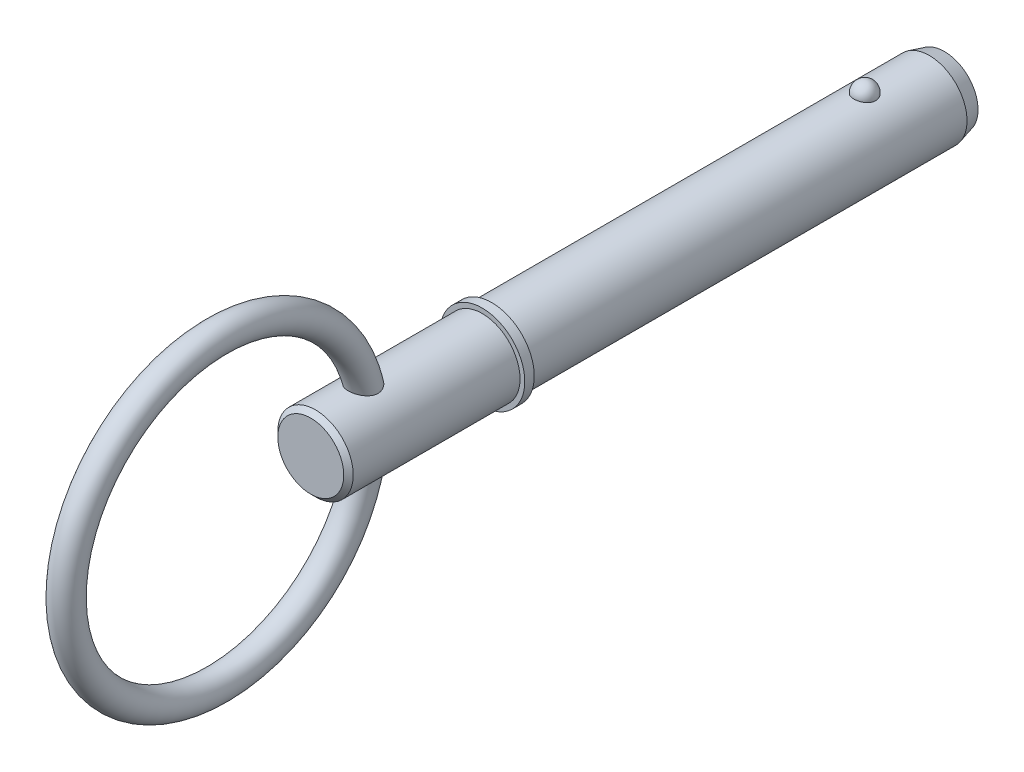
ISO-10303-21;
HEADER;
FILE_DESCRIPTION(('STEP AP214'),'2;1');
FILE_NAME('part.step','',(''),(''),'','','');
FILE_SCHEMA(('AUTOMOTIVE_DESIGN { 1 0 10303 214 1 1 1 1 }'));
ENDSEC;
DATA;
#1=APPLICATION_CONTEXT('core data for automotive mechanical design processes');
#2=APPLICATION_PROTOCOL_DEFINITION('international standard','automotive_design',2000,#1);
#3=PRODUCT_CONTEXT('',#1,'mechanical');
#4=PRODUCT('Part','Part','',(#3));
#5=PRODUCT_RELATED_PRODUCT_CATEGORY('part','',(#4));
#6=PRODUCT_DEFINITION_FORMATION('','',#4);
#7=PRODUCT_DEFINITION_CONTEXT('part definition',#1,'design');
#8=PRODUCT_DEFINITION('design','',#6,#7);
#9=PRODUCT_DEFINITION_SHAPE('','',#8);
#10=(LENGTH_UNIT() NAMED_UNIT(*) SI_UNIT(.MILLI.,.METRE.));
#11=(NAMED_UNIT(*) PLANE_ANGLE_UNIT() SI_UNIT($,.RADIAN.));
#12=(NAMED_UNIT(*) SI_UNIT($,.STERADIAN.) SOLID_ANGLE_UNIT());
#13=UNCERTAINTY_MEASURE_WITH_UNIT(LENGTH_MEASURE(1.E-05),#10,'distance_accuracy_value','');
#14=(GEOMETRIC_REPRESENTATION_CONTEXT(3) GLOBAL_UNCERTAINTY_ASSIGNED_CONTEXT((#13)) GLOBAL_UNIT_ASSIGNED_CONTEXT((#10,
#11,#12)) REPRESENTATION_CONTEXT('',''));
#15=CARTESIAN_POINT('',(0.,0.,0.));
#16=DIRECTION('',(0.,0.,1.));
#17=DIRECTION('',(1.,0.,0.));
#18=AXIS2_PLACEMENT_3D('',#15,#16,#17);
#19=CARTESIAN_POINT('',(0.,0.,38.1));
#20=DIRECTION('',(0.,0.,-1.));
#21=DIRECTION('',(-1.,0.,0.));
#22=AXIS2_PLACEMENT_3D('',#19,#20,#21);
#23=CYLINDRICAL_SURFACE('',#22,3.97);
#24=CARTESIAN_POINT('',(1.13787398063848,3.80343828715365,-1.15));
#25=CARTESIAN_POINT('',(1.13787307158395,3.80343910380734,-1.0857397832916));
#26=CARTESIAN_POINT('',(1.13264657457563,3.80501406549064,-1.02146820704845));
#27=CARTESIAN_POINT('',(1.11186534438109,3.81113760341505,-0.894749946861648));
#28=CARTESIAN_POINT('',(1.09630734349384,3.81568712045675,-0.832303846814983));
#29=CARTESIAN_POINT('',(1.05525533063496,3.82724281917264,-0.711040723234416));
#30=CARTESIAN_POINT('',(1.02976565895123,3.83424792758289,-0.65222212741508));
#31=CARTESIAN_POINT('',(0.969477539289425,3.84993235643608,-0.53981446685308));
#32=CARTESIAN_POINT('',(0.934679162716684,3.85861166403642,-0.486225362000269));
#33=CARTESIAN_POINT('',(0.856427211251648,3.87673176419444,-0.385470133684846));
#34=CARTESIAN_POINT('',(0.812928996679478,3.88617632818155,-0.338339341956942));
#35=CARTESIAN_POINT('',(0.718506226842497,3.90473543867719,-0.252134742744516));
#36=CARTESIAN_POINT('',(0.667581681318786,3.91384998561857,-0.213060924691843));
#37=CARTESIAN_POINT('',(0.559829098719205,3.93070626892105,-0.144169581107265));
#38=CARTESIAN_POINT('',(0.503019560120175,3.93845211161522,-0.114324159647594));
#39=CARTESIAN_POINT('',(0.384957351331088,3.95173781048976,-0.0645874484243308));
#40=CARTESIAN_POINT('',(0.323705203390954,3.95727792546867,-0.0446949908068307));
#41=CARTESIAN_POINT('',(0.1997490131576,3.96544869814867,-0.0157294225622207));
#42=CARTESIAN_POINT('',(0.137095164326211,3.96813298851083,-0.00645660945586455));
#43=CARTESIAN_POINT('',(0.0110617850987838,3.97048461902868,0.00167939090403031));
#44=CARTESIAN_POINT('',(-0.0523176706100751,3.97015226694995,0.000543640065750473));
#45=CARTESIAN_POINT('',(-0.176983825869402,3.96653606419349,-0.0120046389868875));
#46=CARTESIAN_POINT('',(-0.238287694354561,3.96329719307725,-0.0232605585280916));
#47=CARTESIAN_POINT('',(-0.358077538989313,3.95427494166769,-0.0555133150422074));
#48=CARTESIAN_POINT('',(-0.416563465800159,3.94849151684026,-0.0765103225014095));
#49=CARTESIAN_POINT('',(-0.529474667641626,3.93494758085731,-0.127824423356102));
#50=CARTESIAN_POINT('',(-0.583873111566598,3.92717527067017,-0.158197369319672));
#51=CARTESIAN_POINT('',(-0.686796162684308,3.9104901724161,-0.227402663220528));
#52=CARTESIAN_POINT('',(-0.735320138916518,3.90157726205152,-0.266235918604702));
#53=CARTESIAN_POINT('',(-0.826197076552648,3.88336108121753,-0.352210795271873));
#54=CARTESIAN_POINT('',(-0.868404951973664,3.87405356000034,-0.399504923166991));
#55=CARTESIAN_POINT('',(-0.944393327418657,3.85623507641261,-0.500572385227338));
#56=CARTESIAN_POINT('',(-0.978173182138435,3.84772417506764,-0.554346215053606));
#57=CARTESIAN_POINT('',(-1.036841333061,3.83233550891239,-0.667624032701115));
#58=CARTESIAN_POINT('',(-1.06161430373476,3.82547928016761,-0.727190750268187));
#59=CARTESIAN_POINT('',(-1.1010562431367,3.81431496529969,-0.849806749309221));
#60=CARTESIAN_POINT('',(-1.11572551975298,3.81000680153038,-0.912855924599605));
#61=CARTESIAN_POINT('',(-1.13455293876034,3.80444307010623,-1.0403529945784));
#62=CARTESIAN_POINT('',(-1.13875701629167,3.80317416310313,-1.10479351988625));
#63=CARTESIAN_POINT('',(-1.13668244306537,3.80379469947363,-1.23348881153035));
#64=CARTESIAN_POINT('',(-1.13040410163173,3.80568404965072,-1.29774358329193));
#65=CARTESIAN_POINT('',(-1.10758455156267,3.81238701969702,-1.42388263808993));
#66=CARTESIAN_POINT('',(-1.09109911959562,3.81718474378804,-1.48577787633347));
#67=CARTESIAN_POINT('',(-1.04831897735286,3.82915360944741,-1.6058363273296));
#68=CARTESIAN_POINT('',(-1.02202385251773,3.83632485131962,-1.66399938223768));
#69=CARTESIAN_POINT('',(-0.960087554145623,3.85229234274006,-1.77531672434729));
#70=CARTESIAN_POINT('',(-0.924393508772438,3.86109769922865,-1.82844028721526));
#71=CARTESIAN_POINT('',(-0.844617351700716,3.87932868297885,-1.92784641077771));
#72=CARTESIAN_POINT('',(-0.800534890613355,3.88875433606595,-1.97412868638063));
#73=CARTESIAN_POINT('',(-0.704909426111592,3.90722138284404,-2.05875748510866));
#74=CARTESIAN_POINT('',(-0.653336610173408,3.91626104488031,-2.09707073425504));
#75=CARTESIAN_POINT('',(-0.544251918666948,3.93290335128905,-2.16444159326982));
#76=CARTESIAN_POINT('',(-0.486740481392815,3.94050610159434,-2.19349988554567));
#77=CARTESIAN_POINT('',(-0.368186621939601,3.95333328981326,-2.24120607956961));
#78=CARTESIAN_POINT('',(-0.307200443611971,3.9585876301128,-2.25998559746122));
#79=CARTESIAN_POINT('',(-0.182787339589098,3.96627905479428,-2.28716436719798));
#80=CARTESIAN_POINT('',(-0.119360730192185,3.96871650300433,-2.29556495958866));
#81=CARTESIAN_POINT('',(0.00676344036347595,3.97048518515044,-2.30167748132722));
#82=CARTESIAN_POINT('',(0.0694499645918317,3.96987797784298,-2.299601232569));
#83=CARTESIAN_POINT('',(0.19355548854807,3.96576491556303,-2.28530777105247));
#84=CARTESIAN_POINT('',(0.254974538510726,3.96225917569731,-2.27309096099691));
#85=CARTESIAN_POINT('',(0.374550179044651,3.95274547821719,-2.2389384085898));
#86=CARTESIAN_POINT('',(0.432719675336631,3.94674835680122,-2.2170447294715));
#87=CARTESIAN_POINT('',(0.544514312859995,3.93288448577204,-2.16414952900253));
#88=CARTESIAN_POINT('',(0.598139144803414,3.92501760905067,-2.13314738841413));
#89=CARTESIAN_POINT('',(0.700284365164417,3.90809781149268,-2.06228741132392));
#90=CARTESIAN_POINT('',(0.748708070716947,3.89902775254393,-2.02229434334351));
#91=CARTESIAN_POINT('',(0.838215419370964,3.88077133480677,-1.93481443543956));
#92=CARTESIAN_POINT('',(0.87929781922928,3.87158495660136,-1.88732632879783));
#93=CARTESIAN_POINT('',(0.953804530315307,3.85391414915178,-1.78516284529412));
#94=CARTESIAN_POINT('',(0.987071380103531,3.8454460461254,-1.73036973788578));
#95=CARTESIAN_POINT('',(1.04410491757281,3.83035507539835,-1.61582422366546));
#96=CARTESIAN_POINT('',(1.06787445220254,3.82373165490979,-1.5560733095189));
#97=CARTESIAN_POINT('',(1.10358064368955,3.813570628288,-1.43904746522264));
#98=CARTESIAN_POINT('',(1.11641754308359,3.80980198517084,-1.38206535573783));
#99=CARTESIAN_POINT('',(1.13356451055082,3.80473547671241,-1.26672526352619));
#100=CARTESIAN_POINT('',(1.13787480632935,3.80343754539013,-1.20836731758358));
#101=CARTESIAN_POINT('',(1.13787398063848,3.80343828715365,-1.15));
#102=B_SPLINE_CURVE_WITH_KNOTS('',3,(#24,#25,#26,#27,#28,#29,#30,#31,#32,#33,#34,#35,#36,#37,
#38,#39,#40,#41,#42,#43,#44,#45,#46,#47,#48,#49,#50,#51,#52,#53,#54,#55,#56,#57,#58,#59,#60,#61,
#62,#63,#64,#65,#66,#67,#68,#69,#70,#71,#72,#73,#74,#75,#76,#77,#78,#79,#80,#81,#82,#83,#84,#85,
#86,#87,#88,#89,#90,#91,#92,#93,#94,#95,#96,#97,#98,#99,#100,#101),.UNSPECIFIED.,.T.,.F.,(4,2,2,
2,2,2,2,2,2,2,2,2,2,2,2,2,2,2,2,2,2,2,2,2,2,2,2,2,2,2,2,2,2,2,2,2,2,2,4),(0.,0.192571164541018,
0.385203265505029,0.577751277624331,0.770297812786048,0.963858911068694,1.15741975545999,
1.35038964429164,1.54333688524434,1.73259288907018,1.92182958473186,2.10818732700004,
2.2945483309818,2.48204164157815,2.66955507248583,2.86087083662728,3.05220124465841,
3.24590171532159,3.43959628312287,3.63243915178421,3.82527632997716,4.01706893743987,
4.20886965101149,4.40177324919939,4.59468488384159,4.78838651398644,4.9820738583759,
5.17321934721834,5.36434014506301,5.55161251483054,5.7388774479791,5.92533626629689,
6.11180776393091,6.30129785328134,6.49082000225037,6.68388392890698,6.87688993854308,
7.05180628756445,7.22671796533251),.UNSPECIFIED.);
#103=CARTESIAN_POINT('',(1.13787398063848,3.80343828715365,-1.15));
#104=VERTEX_POINT('',#103);
#105=EDGE_CURVE('E102',#104,#104,#102,.T.);
#106=ORIENTED_EDGE('',*,*,#105,.T.);
#107=EDGE_LOOP('',(#106));
#108=FACE_BOUND('',#107,.T.);
#109=CARTESIAN_POINT('',(0.,0.,-7.94400000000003));
#110=DIRECTION('',(0.,0.,-1.));
#111=DIRECTION('',(-1.,0.,0.));
#112=AXIS2_PLACEMENT_3D('',#109,#110,#111);
#113=CIRCLE('',#112,3.97);
#114=CARTESIAN_POINT('',(-3.97,0.,-7.94400000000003));
#115=VERTEX_POINT('',#114);
#116=EDGE_CURVE('E109',#115,#115,#113,.F.);
#117=ORIENTED_EDGE('',*,*,#116,.T.);
#118=EDGE_LOOP('',(#117));
#119=FACE_BOUND('',#118,.T.);
#120=CARTESIAN_POINT('',(0.,0.,38.1));
#121=DIRECTION('',(0.,0.,1.));
#122=DIRECTION('',(1.,0.,0.));
#123=AXIS2_PLACEMENT_3D('',#120,#121,#122);
#124=CIRCLE('',#123,3.97);
#125=CARTESIAN_POINT('',(3.97,0.,38.1));
#126=VERTEX_POINT('',#125);
#127=EDGE_CURVE('E107',#126,#126,#124,.T.);
#128=ORIENTED_EDGE('',*,*,#127,.F.);
#129=EDGE_LOOP('',(#128));
#130=FACE_BOUND('',#129,.T.);
#131=ADVANCED_FACE('F39',(#108,#119,#130),#23,.T.);
#132=CARTESIAN_POINT('',(0.,0.,-9.53));
#133=DIRECTION('',(0.,0.,-1.));
#134=DIRECTION('',(-1.,0.,0.));
#135=AXIS2_PLACEMENT_3D('',#132,#133,#134);
#136=PLANE('',#135);
#137=CARTESIAN_POINT('',(0.,0.,-9.53));
#138=DIRECTION('',(0.,0.,-1.));
#139=DIRECTION('',(-1.,0.,0.));
#140=AXIS2_PLACEMENT_3D('',#137,#138,#139);
#141=CIRCLE('',#140,3.54503258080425);
#142=CARTESIAN_POINT('',(-3.54503258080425,0.,-9.53));
#143=VERTEX_POINT('',#142);
#144=EDGE_CURVE('E142',#143,#143,#141,.T.);
#145=ORIENTED_EDGE('',*,*,#144,.T.);
#146=EDGE_LOOP('',(#145));
#147=FACE_BOUND('',#146,.T.);
#148=ADVANCED_FACE('F88',(#147),#136,.T.);
#149=CARTESIAN_POINT('',(0.,0.,-9.53));
#150=DIRECTION('',(0.,0.,1.));
#151=DIRECTION('',(1.,0.,0.));
#152=AXIS2_PLACEMENT_3D('',#149,#150,#151);
#153=CONICAL_SURFACE('',#152,3.54503258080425,0.26179938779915);
#154=ORIENTED_EDGE('',*,*,#116,.F.);
#155=EDGE_LOOP('',(#154));
#156=FACE_BOUND('',#155,.T.);
#157=ORIENTED_EDGE('',*,*,#144,.F.);
#158=EDGE_LOOP('',(#157));
#159=FACE_BOUND('',#158,.T.);
#160=ADVANCED_FACE('F94',(#156,#159),#153,.T.);
#161=CARTESIAN_POINT('',(0.,3.97,-1.15));
#162=DIRECTION('',(0.,1.,0.));
#163=DIRECTION('',(0.,0.,-1.));
#164=AXIS2_PLACEMENT_3D('',#161,#162,#163);
#165=SPHERICAL_SURFACE('',#164,1.15);
#166=ORIENTED_EDGE('',*,*,#105,.F.);
#167=EDGE_LOOP('',(#166));
#168=FACE_BOUND('',#167,.T.);
#169=ADVANCED_FACE('F112',(#168),#165,.T.);
#170=CARTESIAN_POINT('',(0.,0.,38.1));
#171=DIRECTION('',(0.,0.,-1.));
#172=DIRECTION('',(-1.,0.,0.));
#173=AXIS2_PLACEMENT_3D('',#170,#171,#172);
#174=PLANE('',#173);
#175=ORIENTED_EDGE('',*,*,#127,.T.);
#176=EDGE_LOOP('',(#175));
#177=FACE_BOUND('',#176,.T.);
#178=CARTESIAN_POINT('',(0.,0.,38.1));
#179=DIRECTION('',(0.,0.,-1.));
#180=DIRECTION('',(-1.,0.,0.));
#181=AXIS2_PLACEMENT_3D('',#178,#179,#180);
#182=CIRCLE('',#181,4.47);
#183=CARTESIAN_POINT('',(-4.47,0.,38.1));
#184=VERTEX_POINT('',#183);
#185=EDGE_CURVE('E108',#184,#184,#182,.T.);
#186=ORIENTED_EDGE('',*,*,#185,.T.);
#187=EDGE_LOOP('',(#186));
#188=FACE_BOUND('',#187,.T.);
#189=ADVANCED_FACE('F116',(#177,#188),#174,.T.);
#190=CARTESIAN_POINT('',(0.,0.,33.7287874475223));
#191=DIRECTION('',(0.,0.,-1.));
#192=DIRECTION('',(-1.,0.,0.));
#193=AXIS2_PLACEMENT_3D('',#190,#191,#192);
#194=CYLINDRICAL_SURFACE('',#193,4.47);
#195=CARTESIAN_POINT('',(0.,0.,39.1));
#196=DIRECTION('',(0.,0.,-1.));
#197=DIRECTION('',(-1.,0.,0.));
#198=AXIS2_PLACEMENT_3D('',#195,#196,#197);
#199=CIRCLE('',#198,4.47);
#200=CARTESIAN_POINT('',(-4.47,0.,39.1));
#201=VERTEX_POINT('',#200);
#202=EDGE_CURVE('E133',#201,#201,#199,.T.);
#203=ORIENTED_EDGE('',*,*,#202,.T.);
#204=EDGE_LOOP('',(#203));
#205=FACE_BOUND('',#204,.T.);
#206=ORIENTED_EDGE('',*,*,#185,.F.);
#207=EDGE_LOOP('',(#206));
#208=FACE_BOUND('',#207,.T.);
#209=ADVANCED_FACE('F120',(#205,#208),#194,.T.);
#210=CARTESIAN_POINT('',(0.,4.47,39.1));
#211=DIRECTION('',(0.,0.,1.));
#212=DIRECTION('',(1.,0.,0.));
#213=AXIS2_PLACEMENT_3D('',#210,#211,#212);
#214=PLANE('',#213);
#215=CARTESIAN_POINT('',(0.,0.,39.1));
#216=DIRECTION('',(0.,0.,1.));
#217=DIRECTION('',(1.,0.,0.));
#218=AXIS2_PLACEMENT_3D('',#215,#216,#217);
#219=CIRCLE('',#218,3.97);
#220=CARTESIAN_POINT('',(3.97,0.,39.1));
#221=VERTEX_POINT('',#220);
#222=EDGE_CURVE('E111',#221,#221,#219,.T.);
#223=ORIENTED_EDGE('',*,*,#222,.F.);
#224=EDGE_LOOP('',(#223));
#225=FACE_BOUND('',#224,.T.);
#226=ORIENTED_EDGE('',*,*,#202,.F.);
#227=EDGE_LOOP('',(#226));
#228=FACE_BOUND('',#227,.T.);
#229=ADVANCED_FACE('F85',(#225,#228),#214,.T.);
#230=CARTESIAN_POINT('',(0.,0.,57.15));
#231=DIRECTION('',(0.,0.,-1.));
#232=DIRECTION('',(-1.,0.,0.));
#233=AXIS2_PLACEMENT_3D('',#230,#231,#232);
#234=CYLINDRICAL_SURFACE('',#233,3.97);
#235=CARTESIAN_POINT('',(-0.740636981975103,-3.90030215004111,50.2942081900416));
#236=CARTESIAN_POINT('',(-0.667733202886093,-3.91414543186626,50.254930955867));
#237=CARTESIAN_POINT('',(-0.591347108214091,-3.92651643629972,50.2215983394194));
#238=CARTESIAN_POINT('',(-0.433709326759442,-3.94703799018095,50.1675410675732));
#239=CARTESIAN_POINT('',(-0.352458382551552,-3.95518918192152,50.1468144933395));
#240=CARTESIAN_POINT('',(-0.187320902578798,-3.96644185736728,50.1184263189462));
#241=CARTESIAN_POINT('',(-0.103433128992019,-3.9695409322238,50.1107709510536));
#242=CARTESIAN_POINT('',(0.0645297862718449,-3.97036376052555,50.1087268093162));
#243=CARTESIAN_POINT('',(0.148604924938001,-3.96808759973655,50.1143378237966));
#244=CARTESIAN_POINT('',(0.313967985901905,-3.95842655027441,50.1386101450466));
#245=CARTESIAN_POINT('',(0.395270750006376,-3.95107581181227,50.1571842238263));
#246=CARTESIAN_POINT('',(0.553418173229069,-3.93204472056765,50.2068699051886));
#247=CARTESIAN_POINT('',(0.630262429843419,-3.92036397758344,50.2379826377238));
#248=CARTESIAN_POINT('',(0.77798376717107,-3.89375421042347,50.3123739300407));
#249=CARTESIAN_POINT('',(0.84880915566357,-3.8788003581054,50.3557462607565));
#250=CARTESIAN_POINT('',(0.981880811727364,-3.84727071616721,50.4536515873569));
#251=CARTESIAN_POINT('',(1.04412630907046,-3.83069478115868,50.5081855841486));
#252=CARTESIAN_POINT('',(1.15846819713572,-3.79768496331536,50.6274397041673));
#253=CARTESIAN_POINT('',(1.21053047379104,-3.78125172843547,50.6921927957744));
#254=CARTESIAN_POINT('',(1.30266807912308,-3.75050988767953,50.8301698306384));
#255=CARTESIAN_POINT('',(1.34274789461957,-3.73620048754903,50.9033905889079));
#256=CARTESIAN_POINT('',(1.40857853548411,-3.71187334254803,51.0536278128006));
#257=CARTESIAN_POINT('',(1.43477198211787,-3.70172571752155,51.1304292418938));
#258=CARTESIAN_POINT('',(1.47426417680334,-3.68617713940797,51.2877211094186));
#259=CARTESIAN_POINT('',(1.48756557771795,-3.68077520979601,51.368210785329));
#260=CARTESIAN_POINT('',(1.5011302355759,-3.67526295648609,51.5282774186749));
#261=CARTESIAN_POINT('',(1.50172918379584,-3.67501639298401,51.6078221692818));
#262=CARTESIAN_POINT('',(1.49128692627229,-3.67926498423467,51.7660010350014));
#263=CARTESIAN_POINT('',(1.48024221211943,-3.68376156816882,51.8446348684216));
#264=CARTESIAN_POINT('',(1.44631002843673,-3.69722026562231,52.0039961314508));
#265=CARTESIAN_POINT('',(1.42273446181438,-3.7064405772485,52.0845537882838));
#266=CARTESIAN_POINT('',(1.36440745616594,-3.72830487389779,52.2410229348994));
#267=CARTESIAN_POINT('',(1.32965006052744,-3.74095068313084,52.3169319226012));
#268=CARTESIAN_POINT('',(1.244983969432,-3.77003365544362,52.4715893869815));
#269=CARTESIAN_POINT('',(1.19374759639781,-3.78674477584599,52.5495625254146));
#270=CARTESIAN_POINT('',(1.07927226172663,-3.82094743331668,52.696060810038));
#271=CARTESIAN_POINT('',(1.0160234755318,-3.83843960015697,52.7645781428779));
#272=CARTESIAN_POINT('',(0.875824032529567,-3.87288453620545,52.8922425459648));
#273=CARTESIAN_POINT('',(0.798445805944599,-3.88979192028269,52.9509375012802));
#274=CARTESIAN_POINT('',(0.6332714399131,-3.92005992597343,53.0524486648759));
#275=CARTESIAN_POINT('',(0.545492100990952,-3.93342615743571,53.0952900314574));
#276=CARTESIAN_POINT('',(0.374503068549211,-3.9531041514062,53.1573026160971));
#277=CARTESIAN_POINT('',(0.292250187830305,-3.96011991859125,53.1788718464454));
#278=CARTESIAN_POINT('',(0.124887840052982,-3.96891507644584,53.2058171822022));
#279=CARTESIAN_POINT('',(0.0397822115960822,-3.97070123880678,53.211214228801));
#280=CARTESIAN_POINT('',(-0.116598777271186,-3.96893737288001,53.2058414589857));
#281=CARTESIAN_POINT('',(-0.187977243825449,-3.96616998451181,53.1974431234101));
#282=CARTESIAN_POINT('',(-0.328224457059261,-3.95703238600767,53.1693459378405));
#283=CARTESIAN_POINT('',(-0.397092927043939,-3.95066177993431,53.1496458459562));
#284=CARTESIAN_POINT('',(-0.530777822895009,-3.93493622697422,53.100002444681));
#285=CARTESIAN_POINT('',(-0.595585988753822,-3.92557541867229,53.0700390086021));
#286=CARTESIAN_POINT('',(-0.719890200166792,-3.904694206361,53.0012213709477));
#287=CARTESIAN_POINT('',(-0.779384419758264,-3.89317306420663,52.9623641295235));
#288=CARTESIAN_POINT('',(-0.900171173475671,-3.86715924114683,52.8711356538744));
#289=CARTESIAN_POINT('',(-0.960570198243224,-3.85247602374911,52.8176378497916));
#290=CARTESIAN_POINT('',(-1.07286582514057,-3.82272677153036,52.7024377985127));
#291=CARTESIAN_POINT('',(-1.12475588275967,-3.8076604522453,52.6407293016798));
#292=CARTESIAN_POINT('',(-1.22682603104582,-3.77611978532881,52.5003072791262));
#293=CARTESIAN_POINT('',(-1.27547686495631,-3.75979238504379,52.4204426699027));
#294=CARTESIAN_POINT('',(-1.35956460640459,-3.73021138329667,52.2534537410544));
#295=CARTESIAN_POINT('',(-1.39499536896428,-3.71695921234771,52.1663260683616));
#296=CARTESIAN_POINT('',(-1.45224550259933,-3.6949785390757,51.9837644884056));
#297=CARTESIAN_POINT('',(-1.47355906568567,-3.68641985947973,51.8881485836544));
#298=CARTESIAN_POINT('',(-1.49891316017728,-3.67618897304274,51.6943060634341));
#299=CARTESIAN_POINT('',(-1.50297414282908,-3.67450861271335,51.5960826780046));
#300=CARTESIAN_POINT('',(-1.49322338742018,-3.67847743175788,51.4115204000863));
#301=CARTESIAN_POINT('',(-1.48132891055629,-3.68334053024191,51.325062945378));
#302=CARTESIAN_POINT('',(-1.44277978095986,-3.69860964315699,51.1560202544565));
#303=CARTESIAN_POINT('',(-1.4161310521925,-3.70901343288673,51.0734334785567));
#304=CARTESIAN_POINT('',(-1.35164005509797,-3.73296583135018,50.9217432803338));
#305=CARTESIAN_POINT('',(-1.31494998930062,-3.74616939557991,50.8520907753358));
#306=CARTESIAN_POINT('',(-1.23078033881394,-3.77465882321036,50.7201142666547));
#307=CARTESIAN_POINT('',(-1.18329862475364,-3.7899450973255,50.6577917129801));
#308=CARTESIAN_POINT('',(-1.07555346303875,-3.82196646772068,50.538244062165));
#309=CARTESIAN_POINT('',(-1.01467770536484,-3.83873247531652,50.4815789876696));
#310=CARTESIAN_POINT('',(-0.883925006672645,-3.87093079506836,50.379334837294));
#311=CARTESIAN_POINT('',(-0.814046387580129,-3.88636285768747,50.3337578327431));
#312=CARTESIAN_POINT('',(-0.740636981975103,-3.90030215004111,50.2942081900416));
#313=B_SPLINE_CURVE_WITH_KNOTS('',3,(#235,#236,#237,#238,#239,#240,#241,#242,#243,#244,#245,
#246,#247,#248,#249,#250,#251,#252,#253,#254,#255,#256,#257,#258,#259,#260,#261,#262,#263,#264,
#265,#266,#267,#268,#269,#270,#271,#272,#273,#274,#275,#276,#277,#278,#279,#280,#281,#282,#283,
#284,#285,#286,#287,#288,#289,#290,#291,#292,#293,#294,#295,#296,#297,#298,#299,#300,#301,#302,
#303,#304,#305,#306,#307,#308,#309,#310,#311,#312),.UNSPECIFIED.,.T.,.F.,(4,2,2,2,2,2,2,2,2,2,2,
2,2,2,2,2,2,2,2,2,2,2,2,2,2,2,2,2,2,2,2,2,2,2,2,2,2,2,4),(0.,0.251585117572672,
0.503131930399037,0.754798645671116,1.00646134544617,1.25644674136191,1.50645467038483,
1.75842915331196,2.01042624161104,2.26325358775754,2.5159861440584,2.76008726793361,
3.00413815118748,3.24173115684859,3.47939577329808,3.73171171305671,3.9841622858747,
4.26728153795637,4.55063334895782,4.84469622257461,5.13829042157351,5.39265192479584,
5.64668391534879,5.86142364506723,6.07618697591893,6.29137389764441,6.50663447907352,
6.75172833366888,6.99700982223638,7.28055118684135,7.56422418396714,7.85757857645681,
8.15058512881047,8.41135406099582,8.67201836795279,8.91039015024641,9.14880900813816,
9.40209172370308,9.65542171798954),.UNSPECIFIED.);
#314=CARTESIAN_POINT('',(-0.740636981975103,-3.90030215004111,50.2942081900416));
#315=VERTEX_POINT('',#314);
#316=EDGE_CURVE('E10',#315,#315,#313,.T.);
#317=ORIENTED_EDGE('',*,*,#316,.F.);
#318=EDGE_LOOP('',(#317));
#319=FACE_BOUND('',#318,.T.);
#320=CARTESIAN_POINT('',(-0.740636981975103,3.90030215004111,50.2942081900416));
#321=CARTESIAN_POINT('',(-0.813118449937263,3.88653971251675,50.3332571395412));
#322=CARTESIAN_POINT('',(-0.882149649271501,3.8713229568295,50.3781781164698));
#323=CARTESIAN_POINT('',(-1.01146335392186,3.83956738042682,50.4788428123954));
#324=CARTESIAN_POINT('',(-1.07174704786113,3.82302873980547,50.5345850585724));
#325=CARTESIAN_POINT('',(-1.18196955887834,3.79040422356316,50.6557938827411));
#326=CARTESIAN_POINT('',(-1.23189269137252,3.77431906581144,50.721274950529));
#327=CARTESIAN_POINT('',(-1.31978443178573,3.74449359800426,50.8602948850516));
#328=CARTESIAN_POINT('',(-1.35775694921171,3.73075252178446,50.9338311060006));
#329=CARTESIAN_POINT('',(-1.41974909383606,3.7075981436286,51.0847128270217));
#330=CARTESIAN_POINT('',(-1.44413408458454,3.69807309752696,51.1618910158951));
#331=CARTESIAN_POINT('',(-1.4800654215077,3.6838411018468,51.319590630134));
#332=CARTESIAN_POINT('',(-1.49161368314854,3.67913343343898,51.4001115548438));
#333=CARTESIAN_POINT('',(-1.50187378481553,3.67495610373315,51.5602618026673));
#334=CARTESIAN_POINT('',(-1.50086613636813,3.67537197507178,51.6398709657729));
#335=CARTESIAN_POINT('',(-1.48728932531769,3.68088569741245,51.7979172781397));
#336=CARTESIAN_POINT('',(-1.47471654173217,3.68598501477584,51.8763540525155));
#337=CARTESIAN_POINT('',(-1.43761932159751,3.70061780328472,52.0355940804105));
#338=CARTESIAN_POINT('',(-1.41233843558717,3.71042990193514,52.1161940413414));
#339=CARTESIAN_POINT('',(-1.35057314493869,3.73335405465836,52.2724850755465));
#340=CARTESIAN_POINT('',(-1.31408239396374,3.74646797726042,52.3481733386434));
#341=CARTESIAN_POINT('',(-1.2257172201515,3.77636700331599,52.5020428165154));
#342=CARTESIAN_POINT('',(-1.17251505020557,3.79340436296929,52.5794161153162));
#343=CARTESIAN_POINT('',(-1.05406412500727,3.82800923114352,52.7243069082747));
#344=CARTESIAN_POINT('',(-0.988806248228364,3.84557713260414,52.7918168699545));
#345=CARTESIAN_POINT('',(-0.845287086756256,3.87968695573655,52.9162211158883));
#346=CARTESIAN_POINT('',(-0.766724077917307,3.89618874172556,52.9727822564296));
#347=CARTESIAN_POINT('',(-0.599538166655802,3.92537936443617,53.0696962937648));
#348=CARTESIAN_POINT('',(-0.510933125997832,3.93807482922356,53.1100774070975));
#349=CARTESIAN_POINT('',(-0.339677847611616,3.95624165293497,53.1670085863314));
#350=CARTESIAN_POINT('',(-0.257968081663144,3.96248273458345,53.1861280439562));
#351=CARTESIAN_POINT('',(-0.0922002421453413,3.96979198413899,53.2084736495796));
#352=CARTESIAN_POINT('',(-0.00814495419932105,3.97086604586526,53.2117179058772));
#353=CARTESIAN_POINT('',(0.146484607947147,3.96793776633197,53.2027977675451));
#354=CARTESIAN_POINT('',(0.217212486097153,3.96466338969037,53.1928433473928));
#355=CARTESIAN_POINT('',(0.355938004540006,3.95462310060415,53.1618888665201));
#356=CARTESIAN_POINT('',(0.423935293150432,3.94785673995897,53.140887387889));
#357=CARTESIAN_POINT('',(0.556534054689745,3.93137424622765,53.0886148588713));
#358=CARTESIAN_POINT('',(0.62107563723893,3.92161865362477,53.0572059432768));
#359=CARTESIAN_POINT('',(0.744663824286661,3.90004074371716,52.9855756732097));
#360=CARTESIAN_POINT('',(0.803708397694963,3.88821766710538,52.9453510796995));
#361=CARTESIAN_POINT('',(0.923664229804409,3.86161149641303,52.8510569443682));
#362=CARTESIAN_POINT('',(0.983622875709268,3.84664723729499,52.7958282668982));
#363=CARTESIAN_POINT('',(1.09477654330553,3.816501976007,52.6771942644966));
#364=CARTESIAN_POINT('',(1.14596459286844,3.80132081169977,52.6137825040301));
#365=CARTESIAN_POINT('',(1.24603510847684,3.76980809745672,52.4699890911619));
#366=CARTESIAN_POINT('',(1.29338223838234,3.753652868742,52.3884933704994));
#367=CARTESIAN_POINT('',(1.37450267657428,3.72471527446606,52.2183960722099));
#368=CARTESIAN_POINT('',(1.40827109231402,3.71193412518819,52.1297919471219));
#369=CARTESIAN_POINT('',(1.46140533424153,3.6913461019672,51.9455436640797));
#370=CARTESIAN_POINT('',(1.48042991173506,3.6836576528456,51.8497859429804));
#371=CARTESIAN_POINT('',(1.50115029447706,3.67526750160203,51.6561286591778));
#372=CARTESIAN_POINT('',(1.50286713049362,3.67455732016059,51.5582318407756));
#373=CARTESIAN_POINT('',(1.48878143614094,3.68028077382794,51.3752085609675));
#374=CARTESIAN_POINT('',(1.47496153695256,3.68590609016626,51.2899028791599));
#375=CARTESIAN_POINT('',(1.43287242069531,3.70247002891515,51.1234763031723));
#376=CARTESIAN_POINT('',(1.40460762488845,3.7134070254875,51.0423541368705));
#377=CARTESIAN_POINT('',(1.33714680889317,3.7381964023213,50.8931046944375));
#378=CARTESIAN_POINT('',(1.2989833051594,3.75175245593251,50.8244572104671));
#379=CARTESIAN_POINT('',(1.21206000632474,3.78072797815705,50.6946829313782));
#380=CARTESIAN_POINT('',(1.16329942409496,3.79614758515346,50.6335566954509));
#381=CARTESIAN_POINT('',(1.05526740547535,3.82760231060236,50.5188656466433));
#382=CARTESIAN_POINT('',(0.9957829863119,3.84364346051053,50.4655033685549));
#383=CARTESIAN_POINT('',(0.868651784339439,3.8743538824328,50.3690998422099));
#384=CARTESIAN_POINT('',(0.801003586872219,3.88902291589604,50.3260603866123));
#385=CARTESIAN_POINT('',(0.656696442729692,3.91602140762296,50.2497891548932));
#386=CARTESIAN_POINT('',(0.579799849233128,3.92824686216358,50.2169691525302));
#387=CARTESIAN_POINT('',(0.42121988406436,3.94839960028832,50.1640374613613));
#388=CARTESIAN_POINT('',(0.339536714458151,3.95632706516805,50.1439252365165));
#389=CARTESIAN_POINT('',(0.173681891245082,3.96706909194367,50.1168661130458));
#390=CARTESIAN_POINT('',(0.0895101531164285,3.96988347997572,50.1099196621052));
#391=CARTESIAN_POINT('',(-0.0788915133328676,3.97010941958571,50.1093589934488));
#392=CARTESIAN_POINT('',(-0.16312144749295,3.96752031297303,50.1157463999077));
#393=CARTESIAN_POINT('',(-0.332911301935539,3.9569711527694,50.1422872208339));
#394=CARTESIAN_POINT('',(-0.418363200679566,3.94877687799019,50.1630414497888));
#395=CARTESIAN_POINT('',(-0.584033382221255,3.92769448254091,50.2184250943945));
#396=CARTESIAN_POINT('',(-0.66425117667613,3.91480592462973,50.2530558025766));
#397=CARTESIAN_POINT('',(-0.740636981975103,3.90030215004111,50.2942081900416));
#398=B_SPLINE_CURVE_WITH_KNOTS('',3,(#320,#321,#322,#323,#324,#325,#326,#327,#328,#329,#330,
#331,#332,#333,#334,#335,#336,#337,#338,#339,#340,#341,#342,#343,#344,#345,#346,#347,#348,#349,
#350,#351,#352,#353,#354,#355,#356,#357,#358,#359,#360,#361,#362,#363,#364,#365,#366,#367,#368,
#369,#370,#371,#372,#373,#374,#375,#376,#377,#378,#379,#380,#381,#382,#383,#384,#385,#386,#387,
#388,#389,#390,#391,#392,#393,#394,#395,#396,#397),.UNSPECIFIED.,.T.,.F.,(4,2,2,2,2,2,2,2,2,2,2,
2,2,2,2,2,2,2,2,2,2,2,2,2,2,2,2,2,2,2,2,2,2,2,2,2,2,2,4),(0.,0.250115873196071,
0.500197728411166,0.750655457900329,1.00103116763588,1.24430196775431,1.48753646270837,
1.72534678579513,1.96323159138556,2.21733609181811,2.47158471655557,2.75662009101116,
3.04187201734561,3.3347718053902,3.62715855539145,3.87803518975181,4.12862559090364,
4.34211896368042,4.55563974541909,4.77211030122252,4.98866052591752,5.23635199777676,
5.48423946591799,5.76983687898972,6.05553710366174,6.3476672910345,6.63944246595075,
6.89782349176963,7.15612548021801,7.39414671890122,7.6321856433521,7.87561406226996,
8.11908472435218,8.37137533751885,8.62365530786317,8.87594385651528,9.12826313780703,
9.39182737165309,9.65541616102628),.UNSPECIFIED.);
#399=CARTESIAN_POINT('',(-0.740636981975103,3.90030215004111,50.2942081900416));
#400=VERTEX_POINT('',#399);
#401=EDGE_CURVE('E51',#400,#400,#398,.T.);
#402=ORIENTED_EDGE('',*,*,#401,.F.);
#403=EDGE_LOOP('',(#402));
#404=FACE_BOUND('',#403,.T.);
#405=CARTESIAN_POINT('',(0.,0.,56.65));
#406=DIRECTION('',(0.,0.,-1.));
#407=DIRECTION('',(-1.,0.,0.));
#408=AXIS2_PLACEMENT_3D('',#405,#406,#407);
#409=CIRCLE('',#408,3.97);
#410=CARTESIAN_POINT('',(-3.97,0.,56.65));
#411=VERTEX_POINT('',#410);
#412=EDGE_CURVE('E64',#411,#411,#409,.T.);
#413=ORIENTED_EDGE('',*,*,#412,.T.);
#414=EDGE_LOOP('',(#413));
#415=FACE_BOUND('',#414,.T.);
#416=ORIENTED_EDGE('',*,*,#222,.T.);
#417=EDGE_LOOP('',(#416));
#418=FACE_BOUND('',#417,.T.);
#419=ADVANCED_FACE('F69',(#319,#404,#415,#418),#234,.T.);
#420=CARTESIAN_POINT('',(0.,0.,57.15));
#421=DIRECTION('',(0.,0.,-1.));
#422=DIRECTION('',(-1.,0.,0.));
#423=AXIS2_PLACEMENT_3D('',#420,#421,#422);
#424=PLANE('',#423);
#425=CARTESIAN_POINT('',(0.,0.,57.15));
#426=DIRECTION('',(0.,0.,-1.));
#427=DIRECTION('',(-1.,0.,0.));
#428=AXIS2_PLACEMENT_3D('',#425,#426,#427);
#429=CIRCLE('',#428,3.46999999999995);
#430=CARTESIAN_POINT('',(-3.46999999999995,0.,57.15));
#431=VERTEX_POINT('',#430);
#432=EDGE_CURVE('E58',#431,#431,#429,.F.);
#433=ORIENTED_EDGE('',*,*,#432,.T.);
#434=EDGE_LOOP('',(#433));
#435=FACE_BOUND('',#434,.T.);
#436=ADVANCED_FACE('F76',(#435),#424,.F.);
#437=CARTESIAN_POINT('',(0.,0.,56.65));
#438=DIRECTION('',(0.,0.,-1.));
#439=DIRECTION('',(-1.,0.,0.));
#440=AXIS2_PLACEMENT_3D('',#437,#438,#439);
#441=CONICAL_SURFACE('',#440,3.97,0.785398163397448);
#442=ORIENTED_EDGE('',*,*,#432,.F.);
#443=EDGE_LOOP('',(#442));
#444=FACE_BOUND('',#443,.T.);
#445=ORIENTED_EDGE('',*,*,#412,.F.);
#446=EDGE_LOOP('',(#445));
#447=FACE_BOUND('',#446,.T.);
#448=ADVANCED_FACE('F41',(#444,#447),#441,.T.);
#449=CARTESIAN_POINT('',(0.,0.,67.025));
#450=DIRECTION('',(1.,0.,0.));
#451=DIRECTION('',(0.,0.,-1.));
#452=AXIS2_PLACEMENT_3D('',#449,#450,#451);
#453=TOROIDAL_SURFACE('',#452,15.875,1.5);
#454=ORIENTED_EDGE('',*,*,#316,.T.);
#455=EDGE_LOOP('',(#454));
#456=FACE_BOUND('',#455,.T.);
#457=ORIENTED_EDGE('',*,*,#401,.T.);
#458=EDGE_LOOP('',(#457));
#459=FACE_BOUND('',#458,.T.);
#460=ADVANCED_FACE('F73',(#456,#459),#453,.T.);
#461=CLOSED_SHELL('',(#131,#148,#160,#169,#189,#209,#229,#419,#436,#448,#460));
#462=MANIFOLD_SOLID_BREP('B2',#461);
#463=ADVANCED_BREP_SHAPE_REPRESENTATION('',(#18,#462),#14);
#464=SHAPE_DEFINITION_REPRESENTATION(#9,#463);
ENDSEC;
END-ISO-10303-21;
